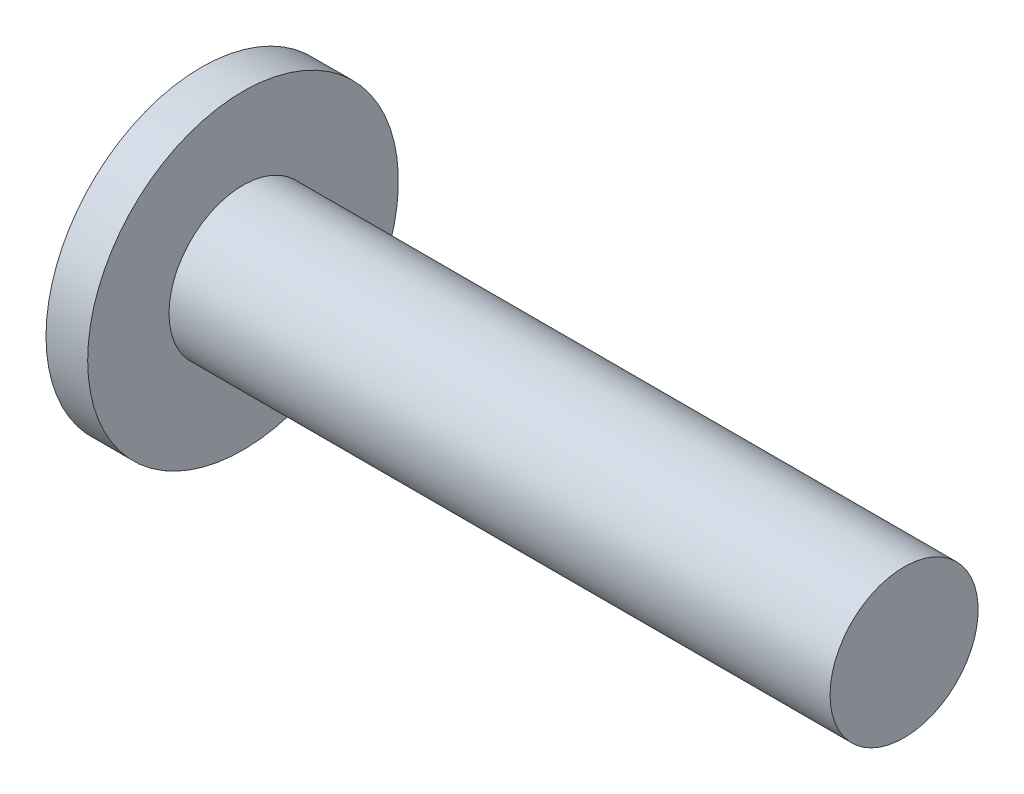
ISO-10303-21;
HEADER;
FILE_DESCRIPTION(('STEP AP214'),'2;1');
FILE_NAME('part.step','',(''),(''),'','','');
FILE_SCHEMA(('AUTOMOTIVE_DESIGN { 1 0 10303 214 1 1 1 1 }'));
ENDSEC;
DATA;
#1=APPLICATION_CONTEXT('core data for automotive mechanical design processes');
#2=APPLICATION_PROTOCOL_DEFINITION('international standard','automotive_design',2000,#1);
#3=PRODUCT_CONTEXT('',#1,'mechanical');
#4=PRODUCT('Part','Part','',(#3));
#5=PRODUCT_RELATED_PRODUCT_CATEGORY('part','',(#4));
#6=PRODUCT_DEFINITION_FORMATION('','',#4);
#7=PRODUCT_DEFINITION_CONTEXT('part definition',#1,'design');
#8=PRODUCT_DEFINITION('design','',#6,#7);
#9=PRODUCT_DEFINITION_SHAPE('','',#8);
#10=(LENGTH_UNIT() NAMED_UNIT(*) SI_UNIT(.MILLI.,.METRE.));
#11=(NAMED_UNIT(*) PLANE_ANGLE_UNIT() SI_UNIT($,.RADIAN.));
#12=(NAMED_UNIT(*) SI_UNIT($,.STERADIAN.) SOLID_ANGLE_UNIT());
#13=UNCERTAINTY_MEASURE_WITH_UNIT(LENGTH_MEASURE(1.E-05),#10,'distance_accuracy_value','');
#14=(GEOMETRIC_REPRESENTATION_CONTEXT(3) GLOBAL_UNCERTAINTY_ASSIGNED_CONTEXT((#13)) GLOBAL_UNIT_ASSIGNED_CONTEXT((#10,
#11,#12)) REPRESENTATION_CONTEXT('',''));
#15=CARTESIAN_POINT('',(0.,0.,0.));
#16=DIRECTION('',(0.,0.,1.));
#17=DIRECTION('',(1.,0.,0.));
#18=AXIS2_PLACEMENT_3D('',#15,#16,#17);
#19=CARTESIAN_POINT('',(5.969,0.,0.));
#20=DIRECTION('',(-1.,0.,0.));
#21=DIRECTION('',(0.,1.,0.));
#22=AXIS2_PLACEMENT_3D('',#19,#20,#21);
#23=SPHERICAL_SURFACE('',#22,5.969);
#24=CARTESIAN_POINT('',(0.799694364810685,0.,0.));
#25=DIRECTION('',(-1.,0.,0.));
#26=DIRECTION('',(0.,0.,1.));
#27=AXIS2_PLACEMENT_3D('',#24,#25,#26);
#28=CIRCLE('',#27,2.9845);
#29=CARTESIAN_POINT('',(0.799694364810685,0.,2.9845));
#30=VERTEX_POINT('',#29);
#31=EDGE_CURVE('E213',#30,#30,#28,.T.);
#32=ORIENTED_EDGE('',*,*,#31,.T.);
#33=EDGE_LOOP('',(#32));
#34=FACE_BOUND('',#33,.T.);
#35=CARTESIAN_POINT('',(4.73521528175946,-2.13697781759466,0.));
#36=DIRECTION('',(0.500000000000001,0.866025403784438,0.));
#37=DIRECTION('',(-0.866025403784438,0.500000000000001,0.));
#38=AXIS2_PLACEMENT_3D('',#35,#36,#37);
#39=CIRCLE('',#38,5.43507700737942);
#40=CARTESIAN_POINT('',(0.0897072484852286,0.545107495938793,-0.875063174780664));
#41=VERTEX_POINT('',#40);
#42=CARTESIAN_POINT('',(0.615623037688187,0.241469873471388,-2.62906987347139));
#43=VERTEX_POINT('',#42);
#44=EDGE_CURVE('E231',#41,#43,#39,.F.);
#45=ORIENTED_EDGE('',*,*,#44,.F.);
#46=CARTESIAN_POINT('',(0.0897072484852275,0.545107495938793,-0.875063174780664));
#47=CARTESIAN_POINT('',(0.0868706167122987,0.546723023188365,-0.855006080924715));
#48=CARTESIAN_POINT('',(0.0843003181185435,0.54993999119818,-0.835017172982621));
#49=CARTESIAN_POINT('',(0.0797655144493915,0.559579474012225,-0.795714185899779));
#50=CARTESIAN_POINT('',(0.0778023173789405,0.566008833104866,-0.77640164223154));
#51=CARTESIAN_POINT('',(0.0745631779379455,0.582091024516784,-0.739029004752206));
#52=CARTESIAN_POINT('',(0.0732891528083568,0.591752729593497,-0.720972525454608));
#53=CARTESIAN_POINT('',(0.0714942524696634,0.614077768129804,-0.686812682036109));
#54=CARTESIAN_POINT('',(0.0709722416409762,0.626736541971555,-0.670706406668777));
#55=CARTESIAN_POINT('',(0.070709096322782,0.654003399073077,-0.641702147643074));
#56=CARTESIAN_POINT('',(0.0709308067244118,0.66848493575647,-0.628685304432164));
#57=CARTESIAN_POINT('',(0.0720645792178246,0.699403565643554,-0.605247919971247));
#58=CARTESIAN_POINT('',(0.0729770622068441,0.715841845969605,-0.594828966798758));
#59=CARTESIAN_POINT('',(0.0754419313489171,0.749976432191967,-0.576922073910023));
#60=CARTESIAN_POINT('',(0.0769876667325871,0.767658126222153,-0.569405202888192));
#61=CARTESIAN_POINT('',(0.080660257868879,0.803901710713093,-0.557248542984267));
#62=CARTESIAN_POINT('',(0.082786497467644,0.822462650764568,-0.552605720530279));
#63=CARTESIAN_POINT('',(0.0865921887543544,0.852450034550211,-0.547449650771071));
#64=CARTESIAN_POINT('',(0.0881079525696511,0.863746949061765,-0.546026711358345));
#65=CARTESIAN_POINT('',(0.0897072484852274,0.875063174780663,-0.545107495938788));
#66=B_SPLINE_CURVE_WITH_KNOTS('',3,(#46,#47,#48,#49,#50,#51,#52,#53,#54,#55,#56,#57,#58,#59,#60,
#61,#62,#63,#64,#65),.UNSPECIFIED.,.F.,.F.,(4,2,2,2,2,2,2,2,2,4),(0.,0.0609361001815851,
0.12200258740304,0.183238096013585,0.244381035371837,0.30251577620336,0.360685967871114,
0.418260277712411,0.475773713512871,0.510180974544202),.UNSPECIFIED.);
#67=CARTESIAN_POINT('',(0.0897072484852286,0.875063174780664,-0.545107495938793));
#68=VERTEX_POINT('',#67);
#69=EDGE_CURVE('E308',#41,#68,#66,.T.);
#70=ORIENTED_EDGE('',*,*,#69,.T.);
#71=CARTESIAN_POINT('',(4.73521528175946,0.,2.13697781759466));
#72=DIRECTION('',(0.500000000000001,0.,-0.866025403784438));
#73=DIRECTION('',(-0.866025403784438,0.,-0.500000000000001));
#74=AXIS2_PLACEMENT_3D('',#71,#72,#73);
#75=CIRCLE('',#74,5.43507700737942);
#76=CARTESIAN_POINT('',(0.615623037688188,2.62906987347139,-0.24146987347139));
#77=VERTEX_POINT('',#76);
#78=EDGE_CURVE('E228',#77,#68,#75,.F.);
#79=ORIENTED_EDGE('',*,*,#78,.F.);
#80=CARTESIAN_POINT('',(5.76907640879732,-0.346277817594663,0.));
#81=DIRECTION('',(0.500000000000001,0.866025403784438,0.));
#82=DIRECTION('',(-0.866025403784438,0.500000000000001,0.));
#83=AXIS2_PLACEMENT_3D('',#80,#81,#82);
#84=CIRCLE('',#83,5.9555926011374);
#85=CARTESIAN_POINT('',(0.615623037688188,2.62906987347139,0.24146987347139));
#86=VERTEX_POINT('',#85);
#87=EDGE_CURVE('E224',#86,#77,#84,.F.);
#88=ORIENTED_EDGE('',*,*,#87,.F.);
#89=CARTESIAN_POINT('',(4.73521528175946,0.,-2.13697781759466));
#90=DIRECTION('',(0.500000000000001,0.,0.866025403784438));
#91=DIRECTION('',(0.866025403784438,0.,-0.500000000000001));
#92=AXIS2_PLACEMENT_3D('',#89,#90,#91);
#93=CIRCLE('',#92,5.43507700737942);
#94=CARTESIAN_POINT('',(0.0897072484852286,0.875063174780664,0.545107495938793));
#95=VERTEX_POINT('',#94);
#96=EDGE_CURVE('E222',#95,#86,#93,.F.);
#97=ORIENTED_EDGE('',*,*,#96,.F.);
#98=CARTESIAN_POINT('',(0.0897072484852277,0.875063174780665,0.545107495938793));
#99=CARTESIAN_POINT('',(0.0868706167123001,0.855006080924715,0.546723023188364));
#100=CARTESIAN_POINT('',(0.0843003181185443,0.835017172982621,0.549939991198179));
#101=CARTESIAN_POINT('',(0.0797655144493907,0.79571418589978,0.559579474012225));
#102=CARTESIAN_POINT('',(0.0778023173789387,0.776401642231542,0.566008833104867));
#103=CARTESIAN_POINT('',(0.0745631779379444,0.739029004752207,0.582091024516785));
#104=CARTESIAN_POINT('',(0.0732891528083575,0.720972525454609,0.591752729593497));
#105=CARTESIAN_POINT('',(0.0714942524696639,0.686812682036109,0.614077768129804));
#106=CARTESIAN_POINT('',(0.0709722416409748,0.670706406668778,0.626736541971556));
#107=CARTESIAN_POINT('',(0.0707090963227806,0.641702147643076,0.654003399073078));
#108=CARTESIAN_POINT('',(0.0709308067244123,0.628685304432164,0.66848493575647));
#109=CARTESIAN_POINT('',(0.0720645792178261,0.605247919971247,0.699403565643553));
#110=CARTESIAN_POINT('',(0.0729770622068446,0.594828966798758,0.715841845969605));
#111=CARTESIAN_POINT('',(0.075441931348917,0.576922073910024,0.749976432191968));
#112=CARTESIAN_POINT('',(0.0769876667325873,0.569405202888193,0.767658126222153));
#113=CARTESIAN_POINT('',(0.0806602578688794,0.557248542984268,0.803901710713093));
#114=CARTESIAN_POINT('',(0.0827864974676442,0.55260572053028,0.822462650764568));
#115=CARTESIAN_POINT('',(0.0865921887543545,0.547449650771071,0.852450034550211));
#116=CARTESIAN_POINT('',(0.0881079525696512,0.546026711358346,0.863746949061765));
#117=CARTESIAN_POINT('',(0.0897072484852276,0.545107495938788,0.875063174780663));
#118=B_SPLINE_CURVE_WITH_KNOTS('',3,(#98,#99,#100,#101,#102,#103,#104,#105,#106,#107,#108,#109,
#110,#111,#112,#113,#114,#115,#116,#117),.UNSPECIFIED.,.F.,.F.,(4,2,2,2,2,2,2,2,2,4),(0.,
0.0609361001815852,0.122002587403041,0.183238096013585,0.244381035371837,0.302515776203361,
0.360685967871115,0.418260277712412,0.475773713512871,0.510180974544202),.UNSPECIFIED.);
#119=CARTESIAN_POINT('',(0.0897072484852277,0.545107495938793,0.875063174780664));
#120=VERTEX_POINT('',#119);
#121=EDGE_CURVE('E243',#95,#120,#118,.T.);
#122=ORIENTED_EDGE('',*,*,#121,.T.);
#123=CARTESIAN_POINT('',(4.73521528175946,-2.13697781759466,0.));
#124=DIRECTION('',(0.500000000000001,0.866025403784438,0.));
#125=DIRECTION('',(-0.866025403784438,0.500000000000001,0.));
#126=AXIS2_PLACEMENT_3D('',#123,#124,#125);
#127=CIRCLE('',#126,5.43507700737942);
#128=CARTESIAN_POINT('',(0.615623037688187,0.241469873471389,2.62906987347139));
#129=VERTEX_POINT('',#128);
#130=EDGE_CURVE('E220',#129,#120,#127,.F.);
#131=ORIENTED_EDGE('',*,*,#130,.F.);
#132=CARTESIAN_POINT('',(5.76907640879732,0.,-0.346277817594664));
#133=DIRECTION('',(0.500000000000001,0.,0.866025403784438));
#134=DIRECTION('',(0.866025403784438,0.,-0.500000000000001));
#135=AXIS2_PLACEMENT_3D('',#132,#133,#134);
#136=CIRCLE('',#135,5.9555926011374);
#137=CARTESIAN_POINT('',(0.615623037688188,-0.24146987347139,2.62906987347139));
#138=VERTEX_POINT('',#137);
#139=EDGE_CURVE('E216',#138,#129,#136,.F.);
#140=ORIENTED_EDGE('',*,*,#139,.F.);
#141=CARTESIAN_POINT('',(4.73521528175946,2.13697781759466,0.));
#142=DIRECTION('',(0.500000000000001,-0.866025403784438,0.));
#143=DIRECTION('',(0.866025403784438,0.500000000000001,0.));
#144=AXIS2_PLACEMENT_3D('',#141,#142,#143);
#145=CIRCLE('',#144,5.43507700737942);
#146=CARTESIAN_POINT('',(0.0897072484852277,-0.545107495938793,0.875063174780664));
#147=VERTEX_POINT('',#146);
#148=EDGE_CURVE('E218',#147,#138,#145,.F.);
#149=ORIENTED_EDGE('',*,*,#148,.F.);
#150=CARTESIAN_POINT('',(0.0897072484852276,-0.545107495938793,0.875063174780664));
#151=CARTESIAN_POINT('',(0.0868706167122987,-0.546723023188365,0.855006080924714));
#152=CARTESIAN_POINT('',(0.0843003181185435,-0.54993999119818,0.835017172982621));
#153=CARTESIAN_POINT('',(0.0797655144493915,-0.559579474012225,0.795714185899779));
#154=CARTESIAN_POINT('',(0.0778023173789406,-0.566008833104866,0.77640164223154));
#155=CARTESIAN_POINT('',(0.0745631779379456,-0.582091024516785,0.739029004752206));
#156=CARTESIAN_POINT('',(0.0732891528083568,-0.591752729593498,0.720972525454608));
#157=CARTESIAN_POINT('',(0.0714942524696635,-0.614077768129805,0.686812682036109));
#158=CARTESIAN_POINT('',(0.0709722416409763,-0.626736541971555,0.670706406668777));
#159=CARTESIAN_POINT('',(0.070709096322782,-0.654003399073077,0.641702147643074));
#160=CARTESIAN_POINT('',(0.0709308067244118,-0.66848493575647,0.628685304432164));
#161=CARTESIAN_POINT('',(0.0720645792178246,-0.699403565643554,0.605247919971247));
#162=CARTESIAN_POINT('',(0.0729770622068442,-0.715841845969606,0.594828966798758));
#163=CARTESIAN_POINT('',(0.0754419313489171,-0.749976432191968,0.576922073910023));
#164=CARTESIAN_POINT('',(0.0769876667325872,-0.767658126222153,0.569405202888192));
#165=CARTESIAN_POINT('',(0.080660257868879,-0.803901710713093,0.557248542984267));
#166=CARTESIAN_POINT('',(0.082786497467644,-0.822462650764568,0.552605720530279));
#167=CARTESIAN_POINT('',(0.0865921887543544,-0.852450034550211,0.54744965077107));
#168=CARTESIAN_POINT('',(0.0881079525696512,-0.863746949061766,0.546026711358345));
#169=CARTESIAN_POINT('',(0.0897072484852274,-0.875063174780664,0.545107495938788));
#170=B_SPLINE_CURVE_WITH_KNOTS('',3,(#150,#151,#152,#153,#154,#155,#156,#157,#158,#159,#160,
#161,#162,#163,#164,#165,#166,#167,#168,#169),.UNSPECIFIED.,.F.,.F.,(4,2,2,2,2,2,2,2,2,4),(0.,
0.060936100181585,0.12200258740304,0.183238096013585,0.244381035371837,0.30251577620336,
0.360685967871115,0.418260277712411,0.475773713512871,0.510180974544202),.UNSPECIFIED.);
#171=CARTESIAN_POINT('',(0.0897072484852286,-0.875063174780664,0.545107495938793));
#172=VERTEX_POINT('',#171);
#173=EDGE_CURVE('E248',#147,#172,#170,.T.);
#174=ORIENTED_EDGE('',*,*,#173,.T.);
#175=CARTESIAN_POINT('',(4.73521528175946,0.,-2.13697781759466));
#176=DIRECTION('',(0.500000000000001,0.,0.866025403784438));
#177=DIRECTION('',(0.866025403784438,0.,-0.500000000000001));
#178=AXIS2_PLACEMENT_3D('',#175,#176,#177);
#179=CIRCLE('',#178,5.43507700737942);
#180=CARTESIAN_POINT('',(0.615623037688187,-2.62906987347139,0.241469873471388));
#181=VERTEX_POINT('',#180);
#182=EDGE_CURVE('E226',#181,#172,#179,.F.);
#183=ORIENTED_EDGE('',*,*,#182,.F.);
#184=CARTESIAN_POINT('',(5.76907640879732,0.346277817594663,0.));
#185=DIRECTION('',(0.500000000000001,-0.866025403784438,0.));
#186=DIRECTION('',(0.866025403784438,0.500000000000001,0.));
#187=AXIS2_PLACEMENT_3D('',#184,#185,#186);
#188=CIRCLE('',#187,5.9555926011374);
#189=CARTESIAN_POINT('',(0.615623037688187,-2.62906987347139,-0.241469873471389));
#190=VERTEX_POINT('',#189);
#191=EDGE_CURVE('E166',#190,#181,#188,.F.);
#192=ORIENTED_EDGE('',*,*,#191,.F.);
#193=CARTESIAN_POINT('',(4.73521528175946,0.,2.13697781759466));
#194=DIRECTION('',(0.500000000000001,0.,-0.866025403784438));
#195=DIRECTION('',(-0.866025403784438,0.,-0.500000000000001));
#196=AXIS2_PLACEMENT_3D('',#193,#194,#195);
#197=CIRCLE('',#196,5.43507700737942);
#198=CARTESIAN_POINT('',(0.0897072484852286,-0.875063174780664,-0.545107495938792));
#199=VERTEX_POINT('',#198);
#200=EDGE_CURVE('E172',#199,#190,#197,.F.);
#201=ORIENTED_EDGE('',*,*,#200,.F.);
#202=CARTESIAN_POINT('',(0.089707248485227,-0.875063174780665,-0.545107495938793));
#203=CARTESIAN_POINT('',(0.0868706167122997,-0.855006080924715,-0.546723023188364));
#204=CARTESIAN_POINT('',(0.0843003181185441,-0.835017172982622,-0.549939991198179));
#205=CARTESIAN_POINT('',(0.0797655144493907,-0.79571418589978,-0.559579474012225));
#206=CARTESIAN_POINT('',(0.0778023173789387,-0.776401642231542,-0.566008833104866));
#207=CARTESIAN_POINT('',(0.0745631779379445,-0.739029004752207,-0.582091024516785));
#208=CARTESIAN_POINT('',(0.0732891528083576,-0.720972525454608,-0.591752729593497));
#209=CARTESIAN_POINT('',(0.071494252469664,-0.686812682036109,-0.614077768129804));
#210=CARTESIAN_POINT('',(0.0709722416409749,-0.670706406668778,-0.626736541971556));
#211=CARTESIAN_POINT('',(0.0707090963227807,-0.641702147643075,-0.654003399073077));
#212=CARTESIAN_POINT('',(0.0709308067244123,-0.628685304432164,-0.66848493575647));
#213=CARTESIAN_POINT('',(0.0720645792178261,-0.605247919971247,-0.699403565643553));
#214=CARTESIAN_POINT('',(0.0729770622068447,-0.594828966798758,-0.715841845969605));
#215=CARTESIAN_POINT('',(0.0754419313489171,-0.576922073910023,-0.749976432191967));
#216=CARTESIAN_POINT('',(0.0769876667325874,-0.569405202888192,-0.767658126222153));
#217=CARTESIAN_POINT('',(0.0806602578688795,-0.557248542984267,-0.803901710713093));
#218=CARTESIAN_POINT('',(0.0827864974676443,-0.552605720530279,-0.822462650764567));
#219=CARTESIAN_POINT('',(0.0865921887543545,-0.547449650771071,-0.852450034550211));
#220=CARTESIAN_POINT('',(0.0881079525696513,-0.546026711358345,-0.863746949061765));
#221=CARTESIAN_POINT('',(0.0897072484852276,-0.545107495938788,-0.875063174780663));
#222=B_SPLINE_CURVE_WITH_KNOTS('',3,(#202,#203,#204,#205,#206,#207,#208,#209,#210,#211,#212,
#213,#214,#215,#216,#217,#218,#219,#220,#221),.UNSPECIFIED.,.F.,.F.,(4,2,2,2,2,2,2,2,2,4),(0.,
0.0609361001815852,0.122002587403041,0.183238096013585,0.244381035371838,0.302515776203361,
0.360685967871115,0.418260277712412,0.475773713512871,0.510180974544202),.UNSPECIFIED.);
#223=CARTESIAN_POINT('',(0.0897072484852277,-0.545107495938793,-0.875063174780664));
#224=VERTEX_POINT('',#223);
#225=EDGE_CURVE('E312',#199,#224,#222,.T.);
#226=ORIENTED_EDGE('',*,*,#225,.T.);
#227=CARTESIAN_POINT('',(4.73521528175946,2.13697781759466,0.));
#228=DIRECTION('',(0.500000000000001,-0.866025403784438,0.));
#229=DIRECTION('',(0.866025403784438,0.500000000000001,0.));
#230=AXIS2_PLACEMENT_3D('',#227,#228,#229);
#231=CIRCLE('',#230,5.43507700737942);
#232=CARTESIAN_POINT('',(0.615623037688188,-0.241469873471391,-2.62906987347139));
#233=VERTEX_POINT('',#232);
#234=EDGE_CURVE('E236',#233,#224,#231,.F.);
#235=ORIENTED_EDGE('',*,*,#234,.F.);
#236=CARTESIAN_POINT('',(5.76907640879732,0.,0.346277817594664));
#237=DIRECTION('',(0.500000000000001,0.,-0.866025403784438));
#238=DIRECTION('',(-0.866025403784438,0.,-0.500000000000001));
#239=AXIS2_PLACEMENT_3D('',#236,#237,#238);
#240=CIRCLE('',#239,5.9555926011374);
#241=EDGE_CURVE('E233',#43,#233,#240,.F.);
#242=ORIENTED_EDGE('',*,*,#241,.F.);
#243=EDGE_LOOP('',(#45,#70,#79,#88,#97,#122,#131,#140,#149,#174,#183,#192,#201,#226,#235,#242));
#244=FACE_BOUND('',#243,.T.);
#245=ADVANCED_FACE('F28',(#34,#244),#23,.T.);
#246=CARTESIAN_POINT('',(0.,0.,0.));
#247=DIRECTION('',(-1.,0.,0.));
#248=DIRECTION('',(0.,0.,1.));
#249=AXIS2_PLACEMENT_3D('',#246,#247,#248);
#250=CYLINDRICAL_SURFACE('',#249,2.9845);
#251=ORIENTED_EDGE('',*,*,#31,.F.);
#252=EDGE_LOOP('',(#251));
#253=FACE_BOUND('',#252,.T.);
#254=CARTESIAN_POINT('',(1.6002,0.,0.));
#255=DIRECTION('',(-1.,0.,0.));
#256=DIRECTION('',(0.,0.,1.));
#257=AXIS2_PLACEMENT_3D('',#254,#255,#256);
#258=CIRCLE('',#257,2.9845);
#259=CARTESIAN_POINT('',(1.6002,0.,2.9845));
#260=VERTEX_POINT('',#259);
#261=EDGE_CURVE('E210',#260,#260,#258,.T.);
#262=ORIENTED_EDGE('',*,*,#261,.T.);
#263=EDGE_LOOP('',(#262));
#264=FACE_BOUND('',#263,.T.);
#265=ADVANCED_FACE('F385',(#253,#264),#250,.T.);
#266=CARTESIAN_POINT('',(1.6002,2.9845,0.));
#267=DIRECTION('',(-1.,0.,0.));
#268=DIRECTION('',(0.,0.,1.));
#269=AXIS2_PLACEMENT_3D('',#266,#267,#268);
#270=PLANE('',#269);
#271=ORIENTED_EDGE('',*,*,#261,.F.);
#272=EDGE_LOOP('',(#271));
#273=FACE_BOUND('',#272,.T.);
#274=CARTESIAN_POINT('',(1.6002,0.,0.));
#275=DIRECTION('',(-1.,0.,0.));
#276=DIRECTION('',(0.,0.,1.));
#277=AXIS2_PLACEMENT_3D('',#274,#275,#276);
#278=CIRCLE('',#277,1.4224);
#279=CARTESIAN_POINT('',(1.6002,0.,1.4224));
#280=VERTEX_POINT('',#279);
#281=EDGE_CURVE('E207',#280,#280,#278,.T.);
#282=ORIENTED_EDGE('',*,*,#281,.T.);
#283=EDGE_LOOP('',(#282));
#284=FACE_BOUND('',#283,.T.);
#285=ADVANCED_FACE('F390',(#273,#284),#270,.F.);
#286=CARTESIAN_POINT('',(0.,0.,0.));
#287=DIRECTION('',(-1.,0.,0.));
#288=DIRECTION('',(0.,0.,1.));
#289=AXIS2_PLACEMENT_3D('',#286,#287,#288);
#290=CYLINDRICAL_SURFACE('',#289,1.4224);
#291=ORIENTED_EDGE('',*,*,#281,.F.);
#292=EDGE_LOOP('',(#291));
#293=FACE_BOUND('',#292,.T.);
#294=CARTESIAN_POINT('',(14.3002,0.,0.));
#295=DIRECTION('',(-1.,0.,0.));
#296=DIRECTION('',(0.,0.,1.));
#297=AXIS2_PLACEMENT_3D('',#294,#295,#296);
#298=CIRCLE('',#297,1.4224);
#299=CARTESIAN_POINT('',(14.3002,0.,1.4224));
#300=VERTEX_POINT('',#299);
#301=EDGE_CURVE('E204',#300,#300,#298,.T.);
#302=ORIENTED_EDGE('',*,*,#301,.T.);
#303=EDGE_LOOP('',(#302));
#304=FACE_BOUND('',#303,.T.);
#305=ADVANCED_FACE('F398',(#293,#304),#290,.T.);
#306=CARTESIAN_POINT('',(14.3002,1.4224,0.));
#307=DIRECTION('',(-1.,0.,0.));
#308=DIRECTION('',(0.,0.,1.));
#309=AXIS2_PLACEMENT_3D('',#306,#307,#308);
#310=PLANE('',#309);
#311=ORIENTED_EDGE('',*,*,#301,.F.);
#312=EDGE_LOOP('',(#311));
#313=FACE_BOUND('',#312,.T.);
#314=ADVANCED_FACE('F404',(#313),#310,.F.);
#315=CARTESIAN_POINT('',(0.,-2.9845,-0.596899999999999));
#316=DIRECTION('',(0.500000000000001,0.,-0.866025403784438));
#317=DIRECTION('',(-0.866025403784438,0.,-0.500000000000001));
#318=AXIS2_PLACEMENT_3D('',#315,#316,#317);
#319=PLANE('',#318);
#320=CARTESIAN_POINT('',(5.26861528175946,0.,2.44493645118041));
#321=DIRECTION('',(0.500000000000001,0.,-0.866025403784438));
#322=DIRECTION('',(-0.866025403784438,0.,-0.500000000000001));
#323=AXIS2_PLACEMENT_3D('',#320,#321,#322);
#324=CIRCLE('',#323,5.25915157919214);
#325=CARTESIAN_POINT('',(1.03386112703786,-1.93592828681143,0.));
#326=VERTEX_POINT('',#325);
#327=CARTESIAN_POINT('',(0.734899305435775,-0.502561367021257,-0.172605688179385));
#328=VERTEX_POINT('',#327);
#329=EDGE_CURVE('E183',#326,#328,#324,.T.);
#330=ORIENTED_EDGE('',*,*,#329,.T.);
#331=DIRECTION('',(0.774596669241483,0.447213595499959,0.447213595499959));
#332=VECTOR('',#331,1.);
#333=CARTESIAN_POINT('',(-0.71278890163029,-1.3383845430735,-1.00842886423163));
#334=LINE('',#333,#332);
#335=EDGE_CURVE('E304',#328,#199,#334,.F.);
#336=ORIENTED_EDGE('',*,*,#335,.T.);
#337=ORIENTED_EDGE('',*,*,#200,.T.);
#338=DIRECTION('',(-0.774596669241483,-0.447213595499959,-0.447213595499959));
#339=VECTOR('',#338,1.);
#340=CARTESIAN_POINT('',(0.,-2.9845,-0.596899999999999));
#341=LINE('',#340,#339);
#342=CARTESIAN_POINT('',(1.03386112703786,-2.3876,0.));
#343=VERTEX_POINT('',#342);
#344=EDGE_CURVE('E164',#343,#190,#341,.T.);
#345=ORIENTED_EDGE('',*,*,#344,.F.);
#346=DIRECTION('',(0.,1.,0.));
#347=VECTOR('',#346,1.);
#348=CARTESIAN_POINT('',(1.03386112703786,-2.9845,0.));
#349=LINE('',#348,#347);
#350=EDGE_CURVE('E146',#343,#326,#349,.T.);
#351=ORIENTED_EDGE('',*,*,#350,.T.);
#352=EDGE_LOOP('',(#330,#336,#337,#345,#351));
#353=FACE_BOUND('',#352,.T.);
#354=ADVANCED_FACE('F169',(#353),#319,.F.);
#355=CARTESIAN_POINT('',(0.,-0.5969,-0.5969));
#356=DIRECTION('',(0.500000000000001,-0.866025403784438,0.));
#357=DIRECTION('',(0.866025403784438,0.500000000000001,0.));
#358=AXIS2_PLACEMENT_3D('',#355,#356,#357);
#359=PLANE('',#358);
#360=ORIENTED_EDGE('',*,*,#234,.T.);
#361=DIRECTION('',(0.774596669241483,0.447213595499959,0.447213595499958));
#362=VECTOR('',#361,1.);
#363=CARTESIAN_POINT('',(0.1143,-0.530908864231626,-0.860864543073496));
#364=LINE('',#363,#362);
#365=CARTESIAN_POINT('',(0.734899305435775,-0.172605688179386,-0.502561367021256));
#366=VERTEX_POINT('',#365);
#367=EDGE_CURVE('E302',#224,#366,#364,.T.);
#368=ORIENTED_EDGE('',*,*,#367,.T.);
#369=CARTESIAN_POINT('',(5.26861528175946,2.44493645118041,0.));
#370=DIRECTION('',(0.500000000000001,-0.866025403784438,0.));
#371=DIRECTION('',(0.866025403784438,0.500000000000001,0.));
#372=AXIS2_PLACEMENT_3D('',#369,#370,#371);
#373=CIRCLE('',#372,5.25915157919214);
#374=CARTESIAN_POINT('',(1.03386112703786,0.,-1.93592828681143));
#375=VERTEX_POINT('',#374);
#376=EDGE_CURVE('E339',#366,#375,#373,.T.);
#377=ORIENTED_EDGE('',*,*,#376,.T.);
#378=DIRECTION('',(0.,0.,1.));
#379=VECTOR('',#378,1.);
#380=CARTESIAN_POINT('',(1.03386112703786,0.,-0.5969));
#381=LINE('',#380,#379);
#382=CARTESIAN_POINT('',(1.03386112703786,0.,-2.3876));
#383=VERTEX_POINT('',#382);
#384=EDGE_CURVE('E173',#383,#375,#381,.T.);
#385=ORIENTED_EDGE('',*,*,#384,.F.);
#386=DIRECTION('',(-0.774596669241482,-0.447213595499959,-0.447213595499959));
#387=VECTOR('',#386,1.);
#388=CARTESIAN_POINT('',(0.413544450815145,-0.35814,-2.74574));
#389=LINE('',#388,#387);
#390=EDGE_CURVE('E174',#383,#233,#389,.T.);
#391=ORIENTED_EDGE('',*,*,#390,.T.);
#392=EDGE_LOOP('',(#360,#368,#377,#385,#391));
#393=FACE_BOUND('',#392,.T.);
#394=ADVANCED_FACE('F347',(#393),#359,.F.);
#395=CARTESIAN_POINT('',(0.,0.5969,-0.5969));
#396=DIRECTION('',(0.500000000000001,0.866025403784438,0.));
#397=DIRECTION('',(-0.866025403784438,0.500000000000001,0.));
#398=AXIS2_PLACEMENT_3D('',#395,#396,#397);
#399=PLANE('',#398);
#400=CARTESIAN_POINT('',(5.26861528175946,-2.44493645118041,0.));
#401=DIRECTION('',(0.500000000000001,0.866025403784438,0.));
#402=DIRECTION('',(-0.866025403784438,0.500000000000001,0.));
#403=AXIS2_PLACEMENT_3D('',#400,#401,#402);
#404=CIRCLE('',#403,5.25915157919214);
#405=CARTESIAN_POINT('',(0.734899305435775,0.172605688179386,-0.502561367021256));
#406=VERTEX_POINT('',#405);
#407=EDGE_CURVE('E337',#375,#406,#404,.T.);
#408=ORIENTED_EDGE('',*,*,#407,.T.);
#409=DIRECTION('',(0.774596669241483,-0.447213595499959,0.447213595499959));
#410=VECTOR('',#409,1.);
#411=CARTESIAN_POINT('',(0.1143,0.530908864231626,-0.860864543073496));
#412=LINE('',#411,#410);
#413=EDGE_CURVE('E240',#406,#41,#412,.F.);
#414=ORIENTED_EDGE('',*,*,#413,.T.);
#415=ORIENTED_EDGE('',*,*,#44,.T.);
#416=DIRECTION('',(-0.774596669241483,0.447213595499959,-0.447213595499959));
#417=VECTOR('',#416,1.);
#418=CARTESIAN_POINT('',(0.827088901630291,0.119379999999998,-2.50698));
#419=LINE('',#418,#417);
#420=EDGE_CURVE('E180',#383,#43,#419,.T.);
#421=ORIENTED_EDGE('',*,*,#420,.F.);
#422=ORIENTED_EDGE('',*,*,#384,.T.);
#423=EDGE_LOOP('',(#408,#414,#415,#421,#422));
#424=FACE_BOUND('',#423,.T.);
#425=ADVANCED_FACE('F353',(#424),#399,.F.);
#426=CARTESIAN_POINT('',(0.,2.9845,-0.5969));
#427=DIRECTION('',(0.500000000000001,0.,-0.866025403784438));
#428=DIRECTION('',(-0.866025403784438,0.,-0.500000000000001));
#429=AXIS2_PLACEMENT_3D('',#426,#427,#428);
#430=PLANE('',#429);
#431=ORIENTED_EDGE('',*,*,#78,.T.);
#432=DIRECTION('',(0.774596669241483,-0.447213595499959,0.447213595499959));
#433=VECTOR('',#432,1.);
#434=CARTESIAN_POINT('',(-0.712788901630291,1.3383845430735,-1.00842886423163));
#435=LINE('',#434,#433);
#436=CARTESIAN_POINT('',(0.734899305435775,0.502561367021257,-0.172605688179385));
#437=VERTEX_POINT('',#436);
#438=EDGE_CURVE('E306',#68,#437,#435,.T.);
#439=ORIENTED_EDGE('',*,*,#438,.T.);
#440=CARTESIAN_POINT('',(5.26861528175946,0.,2.44493645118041));
#441=DIRECTION('',(0.500000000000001,0.,-0.866025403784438));
#442=DIRECTION('',(-0.866025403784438,0.,-0.500000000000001));
#443=AXIS2_PLACEMENT_3D('',#440,#441,#442);
#444=CIRCLE('',#443,5.25915157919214);
#445=CARTESIAN_POINT('',(1.03386112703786,1.93592828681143,0.));
#446=VERTEX_POINT('',#445);
#447=EDGE_CURVE('E335',#437,#446,#444,.T.);
#448=ORIENTED_EDGE('',*,*,#447,.T.);
#449=DIRECTION('',(0.,-1.,0.));
#450=VECTOR('',#449,1.);
#451=CARTESIAN_POINT('',(1.03386112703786,2.9845,0.));
#452=LINE('',#451,#450);
#453=CARTESIAN_POINT('',(1.03386112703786,2.3876,0.));
#454=VERTEX_POINT('',#453);
#455=EDGE_CURVE('E177',#454,#446,#452,.T.);
#456=ORIENTED_EDGE('',*,*,#455,.F.);
#457=DIRECTION('',(-0.774596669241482,0.447213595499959,-0.447213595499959));
#458=VECTOR('',#457,1.);
#459=CARTESIAN_POINT('',(0.,2.9845,-0.5969));
#460=LINE('',#459,#458);
#461=EDGE_CURVE('E194',#454,#77,#460,.T.);
#462=ORIENTED_EDGE('',*,*,#461,.T.);
#463=EDGE_LOOP('',(#431,#439,#448,#456,#462));
#464=FACE_BOUND('',#463,.T.);
#465=ADVANCED_FACE('F362',(#464),#430,.F.);
#466=CARTESIAN_POINT('',(0.,2.9845,0.5969));
#467=DIRECTION('',(0.500000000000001,0.,0.866025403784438));
#468=DIRECTION('',(0.866025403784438,0.,-0.500000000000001));
#469=AXIS2_PLACEMENT_3D('',#466,#467,#468);
#470=PLANE('',#469);
#471=CARTESIAN_POINT('',(5.26861528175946,0.,-2.44493645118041));
#472=DIRECTION('',(0.500000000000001,0.,0.866025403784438));
#473=DIRECTION('',(0.866025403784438,0.,-0.500000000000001));
#474=AXIS2_PLACEMENT_3D('',#471,#472,#473);
#475=CIRCLE('',#474,5.25915157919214);
#476=CARTESIAN_POINT('',(0.734899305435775,0.502561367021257,0.172605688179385));
#477=VERTEX_POINT('',#476);
#478=EDGE_CURVE('E331',#446,#477,#475,.T.);
#479=ORIENTED_EDGE('',*,*,#478,.T.);
#480=DIRECTION('',(0.774596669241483,-0.447213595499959,-0.447213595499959));
#481=VECTOR('',#480,1.);
#482=CARTESIAN_POINT('',(-0.712788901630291,1.3383845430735,1.00842886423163));
#483=LINE('',#482,#481);
#484=EDGE_CURVE('E294',#477,#95,#483,.F.);
#485=ORIENTED_EDGE('',*,*,#484,.T.);
#486=ORIENTED_EDGE('',*,*,#96,.T.);
#487=DIRECTION('',(-0.774596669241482,0.447213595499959,0.447213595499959));
#488=VECTOR('',#487,1.);
#489=CARTESIAN_POINT('',(0.,2.9845,0.5969));
#490=LINE('',#489,#488);
#491=EDGE_CURVE('E191',#454,#86,#490,.T.);
#492=ORIENTED_EDGE('',*,*,#491,.F.);
#493=ORIENTED_EDGE('',*,*,#455,.T.);
#494=EDGE_LOOP('',(#479,#485,#486,#492,#493));
#495=FACE_BOUND('',#494,.T.);
#496=ADVANCED_FACE('F366',(#495),#470,.F.);
#497=CARTESIAN_POINT('',(0.,0.5969,0.5969));
#498=DIRECTION('',(0.500000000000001,0.866025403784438,0.));
#499=DIRECTION('',(-0.866025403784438,0.500000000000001,0.));
#500=AXIS2_PLACEMENT_3D('',#497,#498,#499);
#501=PLANE('',#500);
#502=ORIENTED_EDGE('',*,*,#130,.T.);
#503=DIRECTION('',(0.774596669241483,-0.447213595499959,-0.447213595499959));
#504=VECTOR('',#503,1.);
#505=CARTESIAN_POINT('',(0.1143,0.530908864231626,0.860864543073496));
#506=LINE('',#505,#504);
#507=CARTESIAN_POINT('',(0.734899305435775,0.172605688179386,0.502561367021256));
#508=VERTEX_POINT('',#507);
#509=EDGE_CURVE('E48',#120,#508,#506,.T.);
#510=ORIENTED_EDGE('',*,*,#509,.T.);
#511=CARTESIAN_POINT('',(5.26861528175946,-2.44493645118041,0.));
#512=DIRECTION('',(0.500000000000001,0.866025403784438,0.));
#513=DIRECTION('',(-0.866025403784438,0.500000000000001,0.));
#514=AXIS2_PLACEMENT_3D('',#511,#512,#513);
#515=CIRCLE('',#514,5.25915157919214);
#516=CARTESIAN_POINT('',(1.03386112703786,0.,1.93592828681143));
#517=VERTEX_POINT('',#516);
#518=EDGE_CURVE('E329',#508,#517,#515,.T.);
#519=ORIENTED_EDGE('',*,*,#518,.T.);
#520=DIRECTION('',(0.,0.,-1.));
#521=VECTOR('',#520,1.);
#522=CARTESIAN_POINT('',(1.03386112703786,0.,0.5969));
#523=LINE('',#522,#521);
#524=CARTESIAN_POINT('',(1.03386112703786,0.,2.3876));
#525=VERTEX_POINT('',#524);
#526=EDGE_CURVE('E159',#525,#517,#523,.T.);
#527=ORIENTED_EDGE('',*,*,#526,.F.);
#528=DIRECTION('',(-0.774596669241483,0.447213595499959,0.447213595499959));
#529=VECTOR('',#528,1.);
#530=CARTESIAN_POINT('',(0.,0.5969,2.9845));
#531=LINE('',#530,#529);
#532=EDGE_CURVE('E188',#525,#129,#531,.T.);
#533=ORIENTED_EDGE('',*,*,#532,.T.);
#534=EDGE_LOOP('',(#502,#510,#519,#527,#533));
#535=FACE_BOUND('',#534,.T.);
#536=ADVANCED_FACE('F373',(#535),#501,.F.);
#537=CARTESIAN_POINT('',(0.,-0.5969,0.5969));
#538=DIRECTION('',(0.500000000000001,-0.866025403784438,0.));
#539=DIRECTION('',(0.866025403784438,0.500000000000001,0.));
#540=AXIS2_PLACEMENT_3D('',#537,#538,#539);
#541=PLANE('',#540);
#542=CARTESIAN_POINT('',(5.26861528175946,2.44493645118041,0.));
#543=DIRECTION('',(0.500000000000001,-0.866025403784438,0.));
#544=DIRECTION('',(0.866025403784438,0.500000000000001,0.));
#545=AXIS2_PLACEMENT_3D('',#542,#543,#544);
#546=CIRCLE('',#545,5.25915157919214);
#547=CARTESIAN_POINT('',(0.734899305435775,-0.172605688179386,0.502561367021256));
#548=VERTEX_POINT('',#547);
#549=EDGE_CURVE('E158',#517,#548,#546,.T.);
#550=ORIENTED_EDGE('',*,*,#549,.T.);
#551=DIRECTION('',(0.774596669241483,0.447213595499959,-0.447213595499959));
#552=VECTOR('',#551,1.);
#553=CARTESIAN_POINT('',(0.1143,-0.530908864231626,0.860864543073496));
#554=LINE('',#553,#552);
#555=EDGE_CURVE('E299',#548,#147,#554,.F.);
#556=ORIENTED_EDGE('',*,*,#555,.T.);
#557=ORIENTED_EDGE('',*,*,#148,.T.);
#558=DIRECTION('',(-0.774596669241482,-0.447213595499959,0.447213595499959));
#559=VECTOR('',#558,1.);
#560=CARTESIAN_POINT('',(0.827088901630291,-0.119379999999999,2.50698));
#561=LINE('',#560,#559);
#562=EDGE_CURVE('E167',#525,#138,#561,.T.);
#563=ORIENTED_EDGE('',*,*,#562,.F.);
#564=ORIENTED_EDGE('',*,*,#526,.T.);
#565=EDGE_LOOP('',(#550,#556,#557,#563,#564));
#566=FACE_BOUND('',#565,.T.);
#567=ADVANCED_FACE('F327',(#566),#541,.F.);
#568=CARTESIAN_POINT('',(0.,-2.9845,0.596899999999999));
#569=DIRECTION('',(0.500000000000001,0.,0.866025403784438));
#570=DIRECTION('',(0.866025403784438,0.,-0.500000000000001));
#571=AXIS2_PLACEMENT_3D('',#568,#569,#570);
#572=PLANE('',#571);
#573=ORIENTED_EDGE('',*,*,#182,.T.);
#574=DIRECTION('',(0.774596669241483,0.447213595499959,-0.447213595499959));
#575=VECTOR('',#574,1.);
#576=CARTESIAN_POINT('',(-0.71278890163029,-1.3383845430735,1.00842886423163));
#577=LINE('',#576,#575);
#578=CARTESIAN_POINT('',(0.734899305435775,-0.502561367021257,0.172605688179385));
#579=VERTEX_POINT('',#578);
#580=EDGE_CURVE('E297',#172,#579,#577,.T.);
#581=ORIENTED_EDGE('',*,*,#580,.T.);
#582=CARTESIAN_POINT('',(5.26861528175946,0.,-2.44493645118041));
#583=DIRECTION('',(0.500000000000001,0.,0.866025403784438));
#584=DIRECTION('',(0.866025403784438,0.,-0.500000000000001));
#585=AXIS2_PLACEMENT_3D('',#582,#583,#584);
#586=CIRCLE('',#585,5.25915157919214);
#587=EDGE_CURVE('E153',#579,#326,#586,.T.);
#588=ORIENTED_EDGE('',*,*,#587,.T.);
#589=ORIENTED_EDGE('',*,*,#350,.F.);
#590=DIRECTION('',(-0.774596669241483,-0.447213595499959,0.447213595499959));
#591=VECTOR('',#590,1.);
#592=CARTESIAN_POINT('',(0.413544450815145,-2.74574,0.358139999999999));
#593=LINE('',#592,#591);
#594=EDGE_CURVE('E150',#343,#181,#593,.T.);
#595=ORIENTED_EDGE('',*,*,#594,.T.);
#596=EDGE_LOOP('',(#573,#581,#588,#589,#595));
#597=FACE_BOUND('',#596,.T.);
#598=ADVANCED_FACE('F149',(#597),#572,.F.);
#599=CARTESIAN_POINT('',(0.,-2.9845,-0.596899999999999));
#600=DIRECTION('',(0.500000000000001,-0.866025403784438,0.));
#601=DIRECTION('',(0.866025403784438,0.500000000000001,0.));
#602=AXIS2_PLACEMENT_3D('',#599,#600,#601);
#603=PLANE('',#602);
#604=ORIENTED_EDGE('',*,*,#191,.T.);
#605=ORIENTED_EDGE('',*,*,#594,.F.);
#606=ORIENTED_EDGE('',*,*,#344,.T.);
#607=EDGE_LOOP('',(#604,#605,#606));
#608=FACE_BOUND('',#607,.T.);
#609=ADVANCED_FACE('F163',(#608),#603,.F.);
#610=CARTESIAN_POINT('',(0.,0.5969,-2.9845));
#611=DIRECTION('',(0.500000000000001,0.,-0.866025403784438));
#612=DIRECTION('',(-0.866025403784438,0.,-0.500000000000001));
#613=AXIS2_PLACEMENT_3D('',#610,#611,#612);
#614=PLANE('',#613);
#615=ORIENTED_EDGE('',*,*,#241,.T.);
#616=ORIENTED_EDGE('',*,*,#390,.F.);
#617=ORIENTED_EDGE('',*,*,#420,.T.);
#618=EDGE_LOOP('',(#615,#616,#617));
#619=FACE_BOUND('',#618,.T.);
#620=ADVANCED_FACE('F356',(#619),#614,.F.);
#621=CARTESIAN_POINT('',(0.,2.9845,-0.5969));
#622=DIRECTION('',(0.500000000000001,0.866025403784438,0.));
#623=DIRECTION('',(-0.866025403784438,0.500000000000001,0.));
#624=AXIS2_PLACEMENT_3D('',#621,#622,#623);
#625=PLANE('',#624);
#626=ORIENTED_EDGE('',*,*,#87,.T.);
#627=ORIENTED_EDGE('',*,*,#461,.F.);
#628=ORIENTED_EDGE('',*,*,#491,.T.);
#629=EDGE_LOOP('',(#626,#627,#628));
#630=FACE_BOUND('',#629,.T.);
#631=ADVANCED_FACE('F369',(#630),#625,.F.);
#632=CARTESIAN_POINT('',(0.,0.5969,2.9845));
#633=DIRECTION('',(0.500000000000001,0.,0.866025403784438));
#634=DIRECTION('',(0.866025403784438,0.,-0.500000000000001));
#635=AXIS2_PLACEMENT_3D('',#632,#633,#634);
#636=PLANE('',#635);
#637=ORIENTED_EDGE('',*,*,#139,.T.);
#638=ORIENTED_EDGE('',*,*,#532,.F.);
#639=ORIENTED_EDGE('',*,*,#562,.T.);
#640=EDGE_LOOP('',(#637,#638,#639));
#641=FACE_BOUND('',#640,.T.);
#642=ADVANCED_FACE('F282',(#641),#636,.F.);
#643=CARTESIAN_POINT('',(6.6802,0.,0.));
#644=DIRECTION('',(-1.,0.,0.));
#645=DIRECTION('',(0.,1.,0.));
#646=AXIS2_PLACEMENT_3D('',#643,#644,#645);
#647=SPHERICAL_SURFACE('',#646,5.969);
#648=ORIENTED_EDGE('',*,*,#329,.F.);
#649=ORIENTED_EDGE('',*,*,#587,.F.);
#650=CARTESIAN_POINT('',(0.734899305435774,-0.502561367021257,0.172605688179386));
#651=CARTESIAN_POINT('',(0.733248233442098,-0.482722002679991,0.17353902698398));
#652=CARTESIAN_POINT('',(0.731746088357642,-0.462907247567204,0.175998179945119));
#653=CARTESIAN_POINT('',(0.729078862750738,-0.423834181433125,0.184067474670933));
#654=CARTESIAN_POINT('',(0.727915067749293,-0.404578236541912,0.189689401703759));
#655=CARTESIAN_POINT('',(0.72597313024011,-0.367216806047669,0.204205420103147));
#656=CARTESIAN_POINT('',(0.725196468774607,-0.34911596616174,0.213111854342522));
#657=CARTESIAN_POINT('',(0.72407241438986,-0.314848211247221,0.234047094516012));
#658=CARTESIAN_POINT('',(0.723724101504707,-0.298677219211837,0.246069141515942));
#659=CARTESIAN_POINT('',(0.723480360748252,-0.269901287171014,0.271942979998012));
#660=CARTESIAN_POINT('',(0.723554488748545,-0.257124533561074,0.285603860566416));
#661=CARTESIAN_POINT('',(0.724082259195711,-0.234095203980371,0.314911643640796));
#662=CARTESIAN_POINT('',(0.724536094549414,-0.223843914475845,0.330559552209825));
#663=CARTESIAN_POINT('',(0.725789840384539,-0.206288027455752,0.362957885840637));
#664=CARTESIAN_POINT('',(0.726581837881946,-0.198923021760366,0.379676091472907));
#665=CARTESIAN_POINT('',(0.728481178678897,-0.186878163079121,0.414019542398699));
#666=CARTESIAN_POINT('',(0.729588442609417,-0.182197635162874,0.431644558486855));
#667=CARTESIAN_POINT('',(0.732060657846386,-0.175506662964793,0.467031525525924));
#668=CARTESIAN_POINT('',(0.733420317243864,-0.173447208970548,0.484784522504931));
#669=CARTESIAN_POINT('',(0.734899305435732,-0.172605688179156,0.502561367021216));
#670=B_SPLINE_CURVE_WITH_KNOTS('',3,(#650,#651,#652,#653,#654,#655,#656,#657,#658,#659,#660,
#661,#662,#663,#664,#665,#666,#667,#668,#669),.UNSPECIFIED.,.F.,.F.,(4,2,2,2,2,2,2,2,2,4),(0.,
0.0597859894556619,0.119796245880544,0.18003435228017,0.240142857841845,0.295976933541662,
0.351839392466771,0.406460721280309,0.461068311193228,0.514639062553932),.UNSPECIFIED.);
#671=EDGE_CURVE('E41',#579,#548,#670,.T.);
#672=ORIENTED_EDGE('',*,*,#671,.T.);
#673=ORIENTED_EDGE('',*,*,#549,.F.);
#674=ORIENTED_EDGE('',*,*,#518,.F.);
#675=CARTESIAN_POINT('',(0.734899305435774,0.172605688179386,0.502561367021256));
#676=CARTESIAN_POINT('',(0.733248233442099,0.17353902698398,0.48272200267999));
#677=CARTESIAN_POINT('',(0.731746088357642,0.175998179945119,0.462907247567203));
#678=CARTESIAN_POINT('',(0.729078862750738,0.184067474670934,0.423834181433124));
#679=CARTESIAN_POINT('',(0.727915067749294,0.18968940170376,0.404578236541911));
#680=CARTESIAN_POINT('',(0.725973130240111,0.204205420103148,0.367216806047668));
#681=CARTESIAN_POINT('',(0.725196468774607,0.213111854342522,0.34911596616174));
#682=CARTESIAN_POINT('',(0.724072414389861,0.234047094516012,0.31484821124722));
#683=CARTESIAN_POINT('',(0.723724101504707,0.246069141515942,0.298677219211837));
#684=CARTESIAN_POINT('',(0.723480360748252,0.271942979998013,0.269901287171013));
#685=CARTESIAN_POINT('',(0.723554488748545,0.285603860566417,0.257124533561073));
#686=CARTESIAN_POINT('',(0.724082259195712,0.314911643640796,0.23409520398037));
#687=CARTESIAN_POINT('',(0.724536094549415,0.330559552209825,0.223843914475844));
#688=CARTESIAN_POINT('',(0.725789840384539,0.362957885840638,0.206288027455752));
#689=CARTESIAN_POINT('',(0.726581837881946,0.379676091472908,0.198923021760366));
#690=CARTESIAN_POINT('',(0.728481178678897,0.4140195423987,0.186878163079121));
#691=CARTESIAN_POINT('',(0.729588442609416,0.431644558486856,0.182197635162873));
#692=CARTESIAN_POINT('',(0.732060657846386,0.467031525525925,0.175506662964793));
#693=CARTESIAN_POINT('',(0.733420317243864,0.484784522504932,0.173447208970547));
#694=CARTESIAN_POINT('',(0.734899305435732,0.502561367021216,0.172605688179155));
#695=B_SPLINE_CURVE_WITH_KNOTS('',3,(#675,#676,#677,#678,#679,#680,#681,#682,#683,#684,#685,
#686,#687,#688,#689,#690,#691,#692,#693,#694),.UNSPECIFIED.,.F.,.F.,(4,2,2,2,2,2,2,2,2,4),(0.,
0.0597859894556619,0.119796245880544,0.18003435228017,0.240142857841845,0.295976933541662,
0.351839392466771,0.406460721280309,0.461068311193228,0.514639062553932),.UNSPECIFIED.);
#696=EDGE_CURVE('E11',#508,#477,#695,.T.);
#697=ORIENTED_EDGE('',*,*,#696,.T.);
#698=ORIENTED_EDGE('',*,*,#478,.F.);
#699=ORIENTED_EDGE('',*,*,#447,.F.);
#700=CARTESIAN_POINT('',(0.734899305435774,0.502561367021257,-0.172605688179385));
#701=CARTESIAN_POINT('',(0.733248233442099,0.482722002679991,-0.17353902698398));
#702=CARTESIAN_POINT('',(0.731746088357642,0.462907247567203,-0.175998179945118));
#703=CARTESIAN_POINT('',(0.729078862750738,0.423834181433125,-0.184067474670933));
#704=CARTESIAN_POINT('',(0.727915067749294,0.404578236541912,-0.189689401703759));
#705=CARTESIAN_POINT('',(0.725973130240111,0.367216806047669,-0.204205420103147));
#706=CARTESIAN_POINT('',(0.725196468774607,0.34911596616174,-0.213111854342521));
#707=CARTESIAN_POINT('',(0.724072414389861,0.314848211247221,-0.234047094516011));
#708=CARTESIAN_POINT('',(0.723724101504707,0.298677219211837,-0.246069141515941));
#709=CARTESIAN_POINT('',(0.723480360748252,0.269901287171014,-0.271942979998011));
#710=CARTESIAN_POINT('',(0.723554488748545,0.257124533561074,-0.285603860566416));
#711=CARTESIAN_POINT('',(0.724082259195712,0.234095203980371,-0.314911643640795));
#712=CARTESIAN_POINT('',(0.724536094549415,0.223843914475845,-0.330559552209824));
#713=CARTESIAN_POINT('',(0.725789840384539,0.206288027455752,-0.362957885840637));
#714=CARTESIAN_POINT('',(0.726581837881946,0.198923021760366,-0.379676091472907));
#715=CARTESIAN_POINT('',(0.728481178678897,0.186878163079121,-0.414019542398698));
#716=CARTESIAN_POINT('',(0.729588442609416,0.182197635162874,-0.431644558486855));
#717=CARTESIAN_POINT('',(0.732060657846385,0.175506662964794,-0.467031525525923));
#718=CARTESIAN_POINT('',(0.733420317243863,0.173447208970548,-0.484784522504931));
#719=CARTESIAN_POINT('',(0.734899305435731,0.172605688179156,-0.502561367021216));
#720=B_SPLINE_CURVE_WITH_KNOTS('',3,(#700,#701,#702,#703,#704,#705,#706,#707,#708,#709,#710,
#711,#712,#713,#714,#715,#716,#717,#718,#719),.UNSPECIFIED.,.F.,.F.,(4,2,2,2,2,2,2,2,2,4),(0.,
0.0597859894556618,0.119796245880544,0.18003435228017,0.240142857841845,0.295976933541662,
0.35183939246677,0.406460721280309,0.461068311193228,0.514639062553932),.UNSPECIFIED.);
#721=EDGE_CURVE('E287',#437,#406,#720,.T.);
#722=ORIENTED_EDGE('',*,*,#721,.T.);
#723=ORIENTED_EDGE('',*,*,#407,.F.);
#724=ORIENTED_EDGE('',*,*,#376,.F.);
#725=CARTESIAN_POINT('',(0.734899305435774,-0.172605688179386,-0.502561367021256));
#726=CARTESIAN_POINT('',(0.733248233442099,-0.17353902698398,-0.48272200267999));
#727=CARTESIAN_POINT('',(0.731746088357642,-0.175998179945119,-0.462907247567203));
#728=CARTESIAN_POINT('',(0.729078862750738,-0.184067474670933,-0.423834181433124));
#729=CARTESIAN_POINT('',(0.727915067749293,-0.18968940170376,-0.404578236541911));
#730=CARTESIAN_POINT('',(0.72597313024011,-0.204205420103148,-0.367216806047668));
#731=CARTESIAN_POINT('',(0.725196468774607,-0.213111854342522,-0.34911596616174));
#732=CARTESIAN_POINT('',(0.724072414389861,-0.234047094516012,-0.314848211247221));
#733=CARTESIAN_POINT('',(0.723724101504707,-0.246069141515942,-0.298677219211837));
#734=CARTESIAN_POINT('',(0.723480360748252,-0.271942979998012,-0.269901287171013));
#735=CARTESIAN_POINT('',(0.723554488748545,-0.285603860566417,-0.257124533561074));
#736=CARTESIAN_POINT('',(0.724082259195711,-0.314911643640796,-0.234095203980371));
#737=CARTESIAN_POINT('',(0.724536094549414,-0.330559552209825,-0.223843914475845));
#738=CARTESIAN_POINT('',(0.725789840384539,-0.362957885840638,-0.206288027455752));
#739=CARTESIAN_POINT('',(0.726581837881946,-0.379676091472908,-0.198923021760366));
#740=CARTESIAN_POINT('',(0.728481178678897,-0.414019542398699,-0.18687816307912));
#741=CARTESIAN_POINT('',(0.729588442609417,-0.431644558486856,-0.182197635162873));
#742=CARTESIAN_POINT('',(0.732060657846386,-0.467031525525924,-0.175506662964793));
#743=CARTESIAN_POINT('',(0.733420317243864,-0.484784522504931,-0.173447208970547));
#744=CARTESIAN_POINT('',(0.734899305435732,-0.502561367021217,-0.172605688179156));
#745=B_SPLINE_CURVE_WITH_KNOTS('',3,(#725,#726,#727,#728,#729,#730,#731,#732,#733,#734,#735,
#736,#737,#738,#739,#740,#741,#742,#743,#744),.UNSPECIFIED.,.F.,.F.,(4,2,2,2,2,2,2,2,2,4),(0.,
0.0597859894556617,0.119796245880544,0.18003435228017,0.240142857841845,0.295976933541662,
0.35183939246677,0.406460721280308,0.461068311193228,0.514639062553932),.UNSPECIFIED.);
#746=EDGE_CURVE('E272',#366,#328,#745,.T.);
#747=ORIENTED_EDGE('',*,*,#746,.T.);
#748=EDGE_LOOP('',(#648,#649,#672,#673,#674,#697,#698,#699,#722,#723,#724,#747));
#749=FACE_BOUND('',#748,.T.);
#750=ADVANCED_FACE('F277',(#749),#647,.T.);
#751=CARTESIAN_POINT('',(0.3048,0.860864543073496,-0.860864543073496));
#752=DIRECTION('',(-0.774596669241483,0.447213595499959,-0.447213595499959));
#753=DIRECTION('',(-0.500000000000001,0.,0.866025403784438));
#754=AXIS2_PLACEMENT_3D('',#751,#752,#753);
#755=CYLINDRICAL_SURFACE('',#754,0.381);
#756=ORIENTED_EDGE('',*,*,#721,.F.);
#757=ORIENTED_EDGE('',*,*,#438,.F.);
#758=ORIENTED_EDGE('',*,*,#69,.F.);
#759=ORIENTED_EDGE('',*,*,#413,.F.);
#760=EDGE_LOOP('',(#756,#757,#758,#759));
#761=FACE_BOUND('',#760,.T.);
#762=ADVANCED_FACE('F281',(#761),#755,.T.);
#763=CARTESIAN_POINT('',(-0.52228890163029,-1.3383845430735,-1.3383845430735));
#764=DIRECTION('',(-0.774596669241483,-0.447213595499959,-0.447213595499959));
#765=DIRECTION('',(0.500000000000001,-0.866025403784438,0.));
#766=AXIS2_PLACEMENT_3D('',#763,#764,#765);
#767=CYLINDRICAL_SURFACE('',#766,0.381);
#768=ORIENTED_EDGE('',*,*,#746,.F.);
#769=ORIENTED_EDGE('',*,*,#367,.F.);
#770=ORIENTED_EDGE('',*,*,#225,.F.);
#771=ORIENTED_EDGE('',*,*,#335,.F.);
#772=EDGE_LOOP('',(#768,#769,#770,#771));
#773=FACE_BOUND('',#772,.T.);
#774=ADVANCED_FACE('F263',(#773),#767,.T.);
#775=CARTESIAN_POINT('',(0.3048,-0.860864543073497,0.860864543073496));
#776=DIRECTION('',(-0.774596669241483,-0.447213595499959,0.447213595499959));
#777=DIRECTION('',(0.500000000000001,-0.866025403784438,0.));
#778=AXIS2_PLACEMENT_3D('',#775,#776,#777);
#779=CYLINDRICAL_SURFACE('',#778,0.381);
#780=ORIENTED_EDGE('',*,*,#671,.F.);
#781=ORIENTED_EDGE('',*,*,#580,.F.);
#782=ORIENTED_EDGE('',*,*,#173,.F.);
#783=ORIENTED_EDGE('',*,*,#555,.F.);
#784=EDGE_LOOP('',(#780,#781,#782,#783));
#785=FACE_BOUND('',#784,.T.);
#786=ADVANCED_FACE('F257',(#785),#779,.T.);
#787=CARTESIAN_POINT('',(-0.52228890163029,1.3383845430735,1.3383845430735));
#788=DIRECTION('',(-0.774596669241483,0.447213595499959,0.447213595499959));
#789=DIRECTION('',(0.500000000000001,0.,0.866025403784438));
#790=AXIS2_PLACEMENT_3D('',#787,#788,#789);
#791=CYLINDRICAL_SURFACE('',#790,0.381);
#792=ORIENTED_EDGE('',*,*,#696,.F.);
#793=ORIENTED_EDGE('',*,*,#509,.F.);
#794=ORIENTED_EDGE('',*,*,#121,.F.);
#795=ORIENTED_EDGE('',*,*,#484,.F.);
#796=EDGE_LOOP('',(#792,#793,#794,#795));
#797=FACE_BOUND('',#796,.T.);
#798=ADVANCED_FACE('F254',(#797),#791,.T.);
#799=CLOSED_SHELL('',(#245,#265,#285,#305,#314,#354,#394,#425,#465,#496,#536,#567,#598,#609,
#620,#631,#642,#750,#762,#774,#786,#798));
#800=MANIFOLD_SOLID_BREP('B2',#799);
#801=ADVANCED_BREP_SHAPE_REPRESENTATION('',(#18,#800),#14);
#802=SHAPE_DEFINITION_REPRESENTATION(#9,#801);
ENDSEC;
END-ISO-10303-21;
